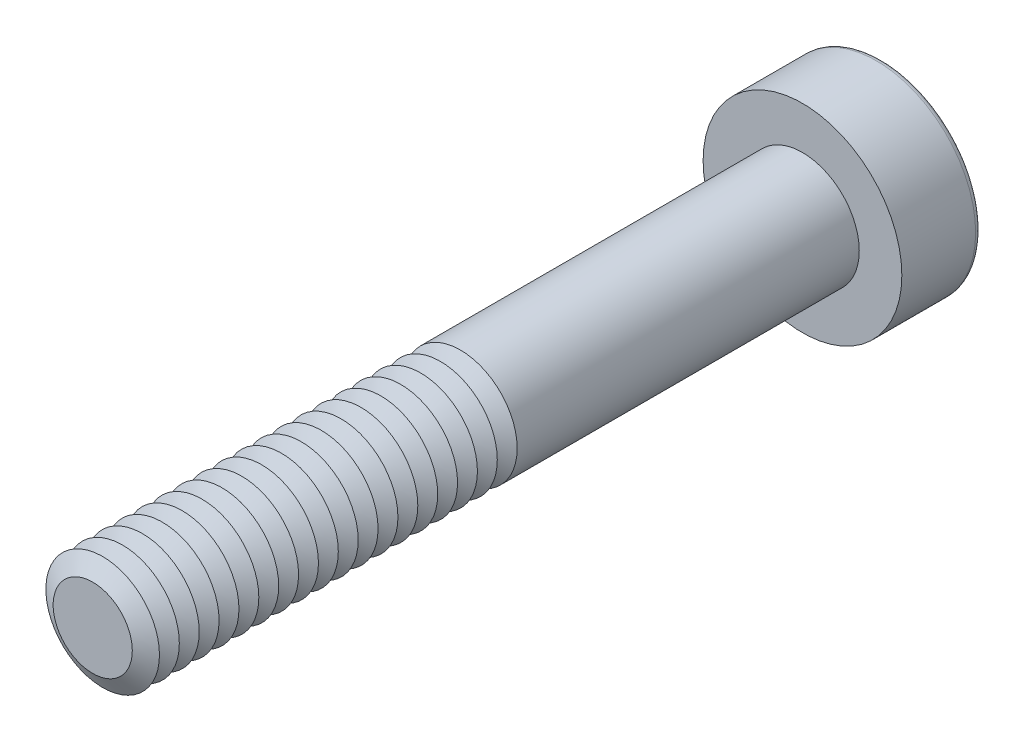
ISO-10303-21;
HEADER;
FILE_DESCRIPTION(('STEP AP214'),'2;1');
FILE_NAME('part.step','',(''),(''),'','','');
FILE_SCHEMA(('AUTOMOTIVE_DESIGN { 1 0 10303 214 1 1 1 1 }'));
ENDSEC;
DATA;
#1=APPLICATION_CONTEXT('core data for automotive mechanical design processes');
#2=APPLICATION_PROTOCOL_DEFINITION('international standard','automotive_design',2000,#1);
#3=PRODUCT_CONTEXT('',#1,'mechanical');
#4=PRODUCT('Part','Part','',(#3));
#5=PRODUCT_RELATED_PRODUCT_CATEGORY('part','',(#4));
#6=PRODUCT_DEFINITION_FORMATION('','',#4);
#7=PRODUCT_DEFINITION_CONTEXT('part definition',#1,'design');
#8=PRODUCT_DEFINITION('design','',#6,#7);
#9=PRODUCT_DEFINITION_SHAPE('','',#8);
#10=(LENGTH_UNIT() NAMED_UNIT(*) SI_UNIT(.MILLI.,.METRE.));
#11=(NAMED_UNIT(*) PLANE_ANGLE_UNIT() SI_UNIT($,.RADIAN.));
#12=(NAMED_UNIT(*) SI_UNIT($,.STERADIAN.) SOLID_ANGLE_UNIT());
#13=UNCERTAINTY_MEASURE_WITH_UNIT(LENGTH_MEASURE(1.E-05),#10,'distance_accuracy_value','');
#14=(GEOMETRIC_REPRESENTATION_CONTEXT(3) GLOBAL_UNCERTAINTY_ASSIGNED_CONTEXT((#13)) GLOBAL_UNIT_ASSIGNED_CONTEXT((#10,
#11,#12)) REPRESENTATION_CONTEXT('',''));
#15=CARTESIAN_POINT('',(0.,0.,0.));
#16=DIRECTION('',(0.,0.,1.));
#17=DIRECTION('',(1.,0.,0.));
#18=AXIS2_PLACEMENT_3D('',#15,#16,#17);
#19=CARTESIAN_POINT('',(0.,0.,22.55));
#20=DIRECTION('',(0.,0.,1.));
#21=DIRECTION('',(1.,0.,0.));
#22=AXIS2_PLACEMENT_3D('',#19,#20,#21);
#23=CONICAL_SURFACE('',#22,2.,1.0471975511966);
#24=CARTESIAN_POINT('',(0.,0.,22.2));
#25=DIRECTION('',(0.,0.,1.));
#26=DIRECTION('',(1.,0.,0.));
#27=AXIS2_PLACEMENT_3D('',#24,#25,#26);
#28=CIRCLE('',#27,1.39378221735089);
#29=CARTESIAN_POINT('',(1.39378221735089,0.,22.2));
#30=VERTEX_POINT('',#29);
#31=EDGE_CURVE('E312',#30,#30,#28,.T.);
#32=ORIENTED_EDGE('',*,*,#31,.T.);
#33=EDGE_LOOP('',(#32));
#34=FACE_BOUND('',#33,.T.);
#35=CARTESIAN_POINT('',(0.,0.,22.55));
#36=DIRECTION('',(0.,0.,1.));
#37=DIRECTION('',(1.,0.,0.));
#38=AXIS2_PLACEMENT_3D('',#35,#36,#37);
#39=CIRCLE('',#38,2.);
#40=CARTESIAN_POINT('',(2.,0.,22.55));
#41=VERTEX_POINT('',#40);
#42=EDGE_CURVE('E315',#41,#41,#39,.T.);
#43=ORIENTED_EDGE('',*,*,#42,.F.);
#44=EDGE_LOOP('',(#43));
#45=FACE_BOUND('',#44,.T.);
#46=ADVANCED_FACE('F39',(#34,#45),#23,.T.);
#47=CARTESIAN_POINT('',(0.,0.,22.2));
#48=DIRECTION('',(0.,0.,-1.));
#49=DIRECTION('',(-1.,0.,0.));
#50=AXIS2_PLACEMENT_3D('',#47,#48,#49);
#51=CONICAL_SURFACE('',#50,1.39378221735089,1.0471975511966);
#52=CARTESIAN_POINT('',(0.,0.,21.85));
#53=DIRECTION('',(0.,0.,1.));
#54=DIRECTION('',(1.,0.,0.));
#55=AXIS2_PLACEMENT_3D('',#52,#53,#54);
#56=CIRCLE('',#55,2.);
#57=CARTESIAN_POINT('',(2.,0.,21.85));
#58=VERTEX_POINT('',#57);
#59=EDGE_CURVE('E323',#58,#58,#56,.T.);
#60=ORIENTED_EDGE('',*,*,#59,.T.);
#61=EDGE_LOOP('',(#60));
#62=FACE_BOUND('',#61,.T.);
#63=ORIENTED_EDGE('',*,*,#31,.F.);
#64=EDGE_LOOP('',(#63));
#65=FACE_BOUND('',#64,.T.);
#66=ADVANCED_FACE('F244',(#62,#65),#51,.T.);
#67=CARTESIAN_POINT('',(0.,0.,25.));
#68=DIRECTION('',(0.,0.,1.));
#69=DIRECTION('',(1.,0.,0.));
#70=AXIS2_PLACEMENT_3D('',#67,#68,#69);
#71=PLANE('',#70);
#72=CARTESIAN_POINT('',(0.,0.,25.));
#73=DIRECTION('',(0.,0.,1.));
#74=DIRECTION('',(1.,0.,0.));
#75=AXIS2_PLACEMENT_3D('',#72,#73,#74);
#76=CIRCLE('',#75,1.39378221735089);
#77=CARTESIAN_POINT('',(1.39378221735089,0.,25.));
#78=VERTEX_POINT('',#77);
#79=EDGE_CURVE('E174',#78,#78,#76,.T.);
#80=ORIENTED_EDGE('',*,*,#79,.T.);
#81=EDGE_LOOP('',(#80));
#82=FACE_BOUND('',#81,.T.);
#83=ADVANCED_FACE('F250',(#82),#71,.T.);
#84=CARTESIAN_POINT('',(0.,0.,25.));
#85=DIRECTION('',(0.,0.,-1.));
#86=DIRECTION('',(-1.,0.,0.));
#87=AXIS2_PLACEMENT_3D('',#84,#85,#86);
#88=CONICAL_SURFACE('',#87,1.39378221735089,1.0471975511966);
#89=CARTESIAN_POINT('',(0.,0.,24.65));
#90=DIRECTION('',(0.,0.,1.));
#91=DIRECTION('',(1.,0.,0.));
#92=AXIS2_PLACEMENT_3D('',#89,#90,#91);
#93=CIRCLE('',#92,2.);
#94=CARTESIAN_POINT('',(2.,0.,24.65));
#95=VERTEX_POINT('',#94);
#96=EDGE_CURVE('E290',#95,#95,#93,.T.);
#97=ORIENTED_EDGE('',*,*,#96,.T.);
#98=EDGE_LOOP('',(#97));
#99=FACE_BOUND('',#98,.T.);
#100=ORIENTED_EDGE('',*,*,#79,.F.);
#101=EDGE_LOOP('',(#100));
#102=FACE_BOUND('',#101,.T.);
#103=ADVANCED_FACE('F199',(#99,#102),#88,.T.);
#104=CARTESIAN_POINT('',(0.,0.,24.65));
#105=DIRECTION('',(0.,0.,1.));
#106=DIRECTION('',(1.,0.,0.));
#107=AXIS2_PLACEMENT_3D('',#104,#105,#106);
#108=CONICAL_SURFACE('',#107,2.,1.0471975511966);
#109=CARTESIAN_POINT('',(0.,0.,24.3));
#110=DIRECTION('',(0.,0.,1.));
#111=DIRECTION('',(1.,0.,0.));
#112=AXIS2_PLACEMENT_3D('',#109,#110,#111);
#113=CIRCLE('',#112,1.39378221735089);
#114=CARTESIAN_POINT('',(1.39378221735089,0.,24.3));
#115=VERTEX_POINT('',#114);
#116=EDGE_CURVE('E287',#115,#115,#113,.T.);
#117=ORIENTED_EDGE('',*,*,#116,.T.);
#118=EDGE_LOOP('',(#117));
#119=FACE_BOUND('',#118,.T.);
#120=ORIENTED_EDGE('',*,*,#96,.F.);
#121=EDGE_LOOP('',(#120));
#122=FACE_BOUND('',#121,.T.);
#123=ADVANCED_FACE('F276',(#119,#122),#108,.T.);
#124=CARTESIAN_POINT('',(0.,0.,24.3));
#125=DIRECTION('',(0.,0.,-1.));
#126=DIRECTION('',(-1.,0.,0.));
#127=AXIS2_PLACEMENT_3D('',#124,#125,#126);
#128=CONICAL_SURFACE('',#127,1.39378221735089,1.0471975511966);
#129=CARTESIAN_POINT('',(0.,0.,23.95));
#130=DIRECTION('',(0.,0.,1.));
#131=DIRECTION('',(1.,0.,0.));
#132=AXIS2_PLACEMENT_3D('',#129,#130,#131);
#133=CIRCLE('',#132,2.);
#134=CARTESIAN_POINT('',(2.,0.,23.95));
#135=VERTEX_POINT('',#134);
#136=EDGE_CURVE('E299',#135,#135,#133,.T.);
#137=ORIENTED_EDGE('',*,*,#136,.T.);
#138=EDGE_LOOP('',(#137));
#139=FACE_BOUND('',#138,.T.);
#140=ORIENTED_EDGE('',*,*,#116,.F.);
#141=EDGE_LOOP('',(#140));
#142=FACE_BOUND('',#141,.T.);
#143=ADVANCED_FACE('F273',(#139,#142),#128,.T.);
#144=CARTESIAN_POINT('',(0.,0.,23.95));
#145=DIRECTION('',(0.,0.,1.));
#146=DIRECTION('',(1.,0.,0.));
#147=AXIS2_PLACEMENT_3D('',#144,#145,#146);
#148=CONICAL_SURFACE('',#147,2.,1.0471975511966);
#149=CARTESIAN_POINT('',(0.,0.,23.6));
#150=DIRECTION('',(0.,0.,1.));
#151=DIRECTION('',(1.,0.,0.));
#152=AXIS2_PLACEMENT_3D('',#149,#150,#151);
#153=CIRCLE('',#152,1.39378221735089);
#154=CARTESIAN_POINT('',(1.39378221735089,0.,23.6));
#155=VERTEX_POINT('',#154);
#156=EDGE_CURVE('E292',#155,#155,#153,.T.);
#157=ORIENTED_EDGE('',*,*,#156,.T.);
#158=EDGE_LOOP('',(#157));
#159=FACE_BOUND('',#158,.T.);
#160=ORIENTED_EDGE('',*,*,#136,.F.);
#161=EDGE_LOOP('',(#160));
#162=FACE_BOUND('',#161,.T.);
#163=ADVANCED_FACE('F269',(#159,#162),#148,.T.);
#164=CARTESIAN_POINT('',(0.,0.,23.6));
#165=DIRECTION('',(0.,0.,-1.));
#166=DIRECTION('',(-1.,0.,0.));
#167=AXIS2_PLACEMENT_3D('',#164,#165,#166);
#168=CONICAL_SURFACE('',#167,1.39378221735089,1.0471975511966);
#169=CARTESIAN_POINT('',(0.,0.,23.25));
#170=DIRECTION('',(0.,0.,1.));
#171=DIRECTION('',(1.,0.,0.));
#172=AXIS2_PLACEMENT_3D('',#169,#170,#171);
#173=CIRCLE('',#172,2.);
#174=CARTESIAN_POINT('',(2.,0.,23.25));
#175=VERTEX_POINT('',#174);
#176=EDGE_CURVE('E309',#175,#175,#173,.T.);
#177=ORIENTED_EDGE('',*,*,#176,.T.);
#178=EDGE_LOOP('',(#177));
#179=FACE_BOUND('',#178,.T.);
#180=ORIENTED_EDGE('',*,*,#156,.F.);
#181=EDGE_LOOP('',(#180));
#182=FACE_BOUND('',#181,.T.);
#183=ADVANCED_FACE('F265',(#179,#182),#168,.T.);
#184=CARTESIAN_POINT('',(0.,0.,23.25));
#185=DIRECTION('',(0.,0.,1.));
#186=DIRECTION('',(1.,0.,0.));
#187=AXIS2_PLACEMENT_3D('',#184,#185,#186);
#188=CONICAL_SURFACE('',#187,2.,1.0471975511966);
#189=CARTESIAN_POINT('',(0.,0.,22.9));
#190=DIRECTION('',(0.,0.,1.));
#191=DIRECTION('',(1.,0.,0.));
#192=AXIS2_PLACEMENT_3D('',#189,#190,#191);
#193=CIRCLE('',#192,1.39378221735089);
#194=CARTESIAN_POINT('',(1.39378221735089,0.,22.9));
#195=VERTEX_POINT('',#194);
#196=EDGE_CURVE('E305',#195,#195,#193,.T.);
#197=ORIENTED_EDGE('',*,*,#196,.T.);
#198=EDGE_LOOP('',(#197));
#199=FACE_BOUND('',#198,.T.);
#200=ORIENTED_EDGE('',*,*,#176,.F.);
#201=EDGE_LOOP('',(#200));
#202=FACE_BOUND('',#201,.T.);
#203=ADVANCED_FACE('F261',(#199,#202),#188,.T.);
#204=CARTESIAN_POINT('',(0.,0.,22.9));
#205=DIRECTION('',(0.,0.,-1.));
#206=DIRECTION('',(-1.,0.,0.));
#207=AXIS2_PLACEMENT_3D('',#204,#205,#206);
#208=CONICAL_SURFACE('',#207,1.39378221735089,1.0471975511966);
#209=ORIENTED_EDGE('',*,*,#42,.T.);
#210=EDGE_LOOP('',(#209));
#211=FACE_BOUND('',#210,.T.);
#212=ORIENTED_EDGE('',*,*,#196,.F.);
#213=EDGE_LOOP('',(#212));
#214=FACE_BOUND('',#213,.T.);
#215=ADVANCED_FACE('F257',(#211,#214),#208,.T.);
#216=CARTESIAN_POINT('',(0.,0.,21.85));
#217=DIRECTION('',(0.,0.,1.));
#218=DIRECTION('',(1.,0.,0.));
#219=AXIS2_PLACEMENT_3D('',#216,#217,#218);
#220=CONICAL_SURFACE('',#219,2.,1.0471975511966);
#221=CARTESIAN_POINT('',(0.,0.,21.5));
#222=DIRECTION('',(0.,0.,1.));
#223=DIRECTION('',(1.,0.,0.));
#224=AXIS2_PLACEMENT_3D('',#221,#222,#223);
#225=CIRCLE('',#224,1.39378221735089);
#226=CARTESIAN_POINT('',(1.39378221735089,0.,21.5));
#227=VERTEX_POINT('',#226);
#228=EDGE_CURVE('E319',#227,#227,#225,.T.);
#229=ORIENTED_EDGE('',*,*,#228,.T.);
#230=EDGE_LOOP('',(#229));
#231=FACE_BOUND('',#230,.T.);
#232=ORIENTED_EDGE('',*,*,#59,.F.);
#233=EDGE_LOOP('',(#232));
#234=FACE_BOUND('',#233,.T.);
#235=ADVANCED_FACE('F260',(#231,#234),#220,.T.);
#236=CARTESIAN_POINT('',(0.,0.,21.5));
#237=DIRECTION('',(0.,0.,-1.));
#238=DIRECTION('',(-1.,0.,0.));
#239=AXIS2_PLACEMENT_3D('',#236,#237,#238);
#240=CONICAL_SURFACE('',#239,1.39378221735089,1.0471975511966);
#241=CARTESIAN_POINT('',(0.,0.,21.15));
#242=DIRECTION('',(0.,0.,1.));
#243=DIRECTION('',(1.,0.,0.));
#244=AXIS2_PLACEMENT_3D('',#241,#242,#243);
#245=CIRCLE('',#244,2.);
#246=CARTESIAN_POINT('',(2.,0.,21.15));
#247=VERTEX_POINT('',#246);
#248=EDGE_CURVE('E330',#247,#247,#245,.T.);
#249=ORIENTED_EDGE('',*,*,#248,.T.);
#250=EDGE_LOOP('',(#249));
#251=FACE_BOUND('',#250,.T.);
#252=ORIENTED_EDGE('',*,*,#228,.F.);
#253=EDGE_LOOP('',(#252));
#254=FACE_BOUND('',#253,.T.);
#255=ADVANCED_FACE('F543',(#251,#254),#240,.T.);
#256=CARTESIAN_POINT('',(0.,0.,21.15));
#257=DIRECTION('',(0.,0.,1.));
#258=DIRECTION('',(1.,0.,0.));
#259=AXIS2_PLACEMENT_3D('',#256,#257,#258);
#260=CONICAL_SURFACE('',#259,2.,1.0471975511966);
#261=CARTESIAN_POINT('',(0.,0.,20.8));
#262=DIRECTION('',(0.,0.,1.));
#263=DIRECTION('',(1.,0.,0.));
#264=AXIS2_PLACEMENT_3D('',#261,#262,#263);
#265=CIRCLE('',#264,1.39378221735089);
#266=CARTESIAN_POINT('',(1.39378221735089,0.,20.8));
#267=VERTEX_POINT('',#266);
#268=EDGE_CURVE('E326',#267,#267,#265,.T.);
#269=ORIENTED_EDGE('',*,*,#268,.T.);
#270=EDGE_LOOP('',(#269));
#271=FACE_BOUND('',#270,.T.);
#272=ORIENTED_EDGE('',*,*,#248,.F.);
#273=EDGE_LOOP('',(#272));
#274=FACE_BOUND('',#273,.T.);
#275=ADVANCED_FACE('F539',(#271,#274),#260,.T.);
#276=CARTESIAN_POINT('',(0.,0.,20.8));
#277=DIRECTION('',(0.,0.,-1.));
#278=DIRECTION('',(-1.,0.,0.));
#279=AXIS2_PLACEMENT_3D('',#276,#277,#278);
#280=CONICAL_SURFACE('',#279,1.39378221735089,1.0471975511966);
#281=CARTESIAN_POINT('',(0.,0.,20.45));
#282=DIRECTION('',(0.,0.,1.));
#283=DIRECTION('',(1.,0.,0.));
#284=AXIS2_PLACEMENT_3D('',#281,#282,#283);
#285=CIRCLE('',#284,2.);
#286=CARTESIAN_POINT('',(2.,0.,20.45));
#287=VERTEX_POINT('',#286);
#288=EDGE_CURVE('E338',#287,#287,#285,.T.);
#289=ORIENTED_EDGE('',*,*,#288,.T.);
#290=EDGE_LOOP('',(#289));
#291=FACE_BOUND('',#290,.T.);
#292=ORIENTED_EDGE('',*,*,#268,.F.);
#293=EDGE_LOOP('',(#292));
#294=FACE_BOUND('',#293,.T.);
#295=ADVANCED_FACE('F535',(#291,#294),#280,.T.);
#296=CARTESIAN_POINT('',(0.,0.,20.45));
#297=DIRECTION('',(0.,0.,1.));
#298=DIRECTION('',(1.,0.,0.));
#299=AXIS2_PLACEMENT_3D('',#296,#297,#298);
#300=CONICAL_SURFACE('',#299,2.,1.0471975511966);
#301=CARTESIAN_POINT('',(0.,0.,20.1));
#302=DIRECTION('',(0.,0.,1.));
#303=DIRECTION('',(1.,0.,0.));
#304=AXIS2_PLACEMENT_3D('',#301,#302,#303);
#305=CIRCLE('',#304,1.39378221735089);
#306=CARTESIAN_POINT('',(1.39378221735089,0.,20.1));
#307=VERTEX_POINT('',#306);
#308=EDGE_CURVE('E334',#307,#307,#305,.T.);
#309=ORIENTED_EDGE('',*,*,#308,.T.);
#310=EDGE_LOOP('',(#309));
#311=FACE_BOUND('',#310,.T.);
#312=ORIENTED_EDGE('',*,*,#288,.F.);
#313=EDGE_LOOP('',(#312));
#314=FACE_BOUND('',#313,.T.);
#315=ADVANCED_FACE('F531',(#311,#314),#300,.T.);
#316=CARTESIAN_POINT('',(0.,0.,20.1));
#317=DIRECTION('',(0.,0.,-1.));
#318=DIRECTION('',(-1.,0.,0.));
#319=AXIS2_PLACEMENT_3D('',#316,#317,#318);
#320=CONICAL_SURFACE('',#319,1.39378221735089,1.0471975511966);
#321=CARTESIAN_POINT('',(0.,0.,19.75));
#322=DIRECTION('',(0.,0.,1.));
#323=DIRECTION('',(1.,0.,0.));
#324=AXIS2_PLACEMENT_3D('',#321,#322,#323);
#325=CIRCLE('',#324,2.);
#326=CARTESIAN_POINT('',(2.,0.,19.75));
#327=VERTEX_POINT('',#326);
#328=EDGE_CURVE('E346',#327,#327,#325,.T.);
#329=ORIENTED_EDGE('',*,*,#328,.T.);
#330=EDGE_LOOP('',(#329));
#331=FACE_BOUND('',#330,.T.);
#332=ORIENTED_EDGE('',*,*,#308,.F.);
#333=EDGE_LOOP('',(#332));
#334=FACE_BOUND('',#333,.T.);
#335=ADVANCED_FACE('F527',(#331,#334),#320,.T.);
#336=CARTESIAN_POINT('',(0.,0.,19.75));
#337=DIRECTION('',(0.,0.,1.));
#338=DIRECTION('',(1.,0.,0.));
#339=AXIS2_PLACEMENT_3D('',#336,#337,#338);
#340=CONICAL_SURFACE('',#339,2.,1.0471975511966);
#341=CARTESIAN_POINT('',(0.,0.,19.4));
#342=DIRECTION('',(0.,0.,1.));
#343=DIRECTION('',(1.,0.,0.));
#344=AXIS2_PLACEMENT_3D('',#341,#342,#343);
#345=CIRCLE('',#344,1.39378221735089);
#346=CARTESIAN_POINT('',(1.39378221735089,0.,19.4));
#347=VERTEX_POINT('',#346);
#348=EDGE_CURVE('E342',#347,#347,#345,.T.);
#349=ORIENTED_EDGE('',*,*,#348,.T.);
#350=EDGE_LOOP('',(#349));
#351=FACE_BOUND('',#350,.T.);
#352=ORIENTED_EDGE('',*,*,#328,.F.);
#353=EDGE_LOOP('',(#352));
#354=FACE_BOUND('',#353,.T.);
#355=ADVANCED_FACE('F523',(#351,#354),#340,.T.);
#356=CARTESIAN_POINT('',(0.,0.,19.4));
#357=DIRECTION('',(0.,0.,-1.));
#358=DIRECTION('',(-1.,0.,0.));
#359=AXIS2_PLACEMENT_3D('',#356,#357,#358);
#360=CONICAL_SURFACE('',#359,1.39378221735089,1.0471975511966);
#361=CARTESIAN_POINT('',(0.,0.,19.05));
#362=DIRECTION('',(0.,0.,1.));
#363=DIRECTION('',(1.,0.,0.));
#364=AXIS2_PLACEMENT_3D('',#361,#362,#363);
#365=CIRCLE('',#364,2.);
#366=CARTESIAN_POINT('',(2.,0.,19.05));
#367=VERTEX_POINT('',#366);
#368=EDGE_CURVE('E354',#367,#367,#365,.T.);
#369=ORIENTED_EDGE('',*,*,#368,.T.);
#370=EDGE_LOOP('',(#369));
#371=FACE_BOUND('',#370,.T.);
#372=ORIENTED_EDGE('',*,*,#348,.F.);
#373=EDGE_LOOP('',(#372));
#374=FACE_BOUND('',#373,.T.);
#375=ADVANCED_FACE('F519',(#371,#374),#360,.T.);
#376=CARTESIAN_POINT('',(0.,0.,19.05));
#377=DIRECTION('',(0.,0.,1.));
#378=DIRECTION('',(1.,0.,0.));
#379=AXIS2_PLACEMENT_3D('',#376,#377,#378);
#380=CONICAL_SURFACE('',#379,2.,1.0471975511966);
#381=CARTESIAN_POINT('',(0.,0.,18.7));
#382=DIRECTION('',(0.,0.,1.));
#383=DIRECTION('',(1.,0.,0.));
#384=AXIS2_PLACEMENT_3D('',#381,#382,#383);
#385=CIRCLE('',#384,1.39378221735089);
#386=CARTESIAN_POINT('',(1.39378221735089,0.,18.7));
#387=VERTEX_POINT('',#386);
#388=EDGE_CURVE('E350',#387,#387,#385,.T.);
#389=ORIENTED_EDGE('',*,*,#388,.T.);
#390=EDGE_LOOP('',(#389));
#391=FACE_BOUND('',#390,.T.);
#392=ORIENTED_EDGE('',*,*,#368,.F.);
#393=EDGE_LOOP('',(#392));
#394=FACE_BOUND('',#393,.T.);
#395=ADVANCED_FACE('F515',(#391,#394),#380,.T.);
#396=CARTESIAN_POINT('',(0.,0.,18.7));
#397=DIRECTION('',(0.,0.,-1.));
#398=DIRECTION('',(-1.,0.,0.));
#399=AXIS2_PLACEMENT_3D('',#396,#397,#398);
#400=CONICAL_SURFACE('',#399,1.39378221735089,1.0471975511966);
#401=CARTESIAN_POINT('',(0.,0.,18.35));
#402=DIRECTION('',(0.,0.,1.));
#403=DIRECTION('',(1.,0.,0.));
#404=AXIS2_PLACEMENT_3D('',#401,#402,#403);
#405=CIRCLE('',#404,2.);
#406=CARTESIAN_POINT('',(2.,0.,18.35));
#407=VERTEX_POINT('',#406);
#408=EDGE_CURVE('E362',#407,#407,#405,.T.);
#409=ORIENTED_EDGE('',*,*,#408,.T.);
#410=EDGE_LOOP('',(#409));
#411=FACE_BOUND('',#410,.T.);
#412=ORIENTED_EDGE('',*,*,#388,.F.);
#413=EDGE_LOOP('',(#412));
#414=FACE_BOUND('',#413,.T.);
#415=ADVANCED_FACE('F511',(#411,#414),#400,.T.);
#416=CARTESIAN_POINT('',(0.,0.,18.35));
#417=DIRECTION('',(0.,0.,1.));
#418=DIRECTION('',(1.,0.,0.));
#419=AXIS2_PLACEMENT_3D('',#416,#417,#418);
#420=CONICAL_SURFACE('',#419,2.,1.0471975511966);
#421=CARTESIAN_POINT('',(0.,0.,18.));
#422=DIRECTION('',(0.,0.,1.));
#423=DIRECTION('',(1.,0.,0.));
#424=AXIS2_PLACEMENT_3D('',#421,#422,#423);
#425=CIRCLE('',#424,1.39378221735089);
#426=CARTESIAN_POINT('',(1.39378221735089,0.,18.));
#427=VERTEX_POINT('',#426);
#428=EDGE_CURVE('E358',#427,#427,#425,.T.);
#429=ORIENTED_EDGE('',*,*,#428,.T.);
#430=EDGE_LOOP('',(#429));
#431=FACE_BOUND('',#430,.T.);
#432=ORIENTED_EDGE('',*,*,#408,.F.);
#433=EDGE_LOOP('',(#432));
#434=FACE_BOUND('',#433,.T.);
#435=ADVANCED_FACE('F507',(#431,#434),#420,.T.);
#436=CARTESIAN_POINT('',(0.,0.,18.));
#437=DIRECTION('',(0.,0.,-1.));
#438=DIRECTION('',(-1.,0.,0.));
#439=AXIS2_PLACEMENT_3D('',#436,#437,#438);
#440=CONICAL_SURFACE('',#439,1.39378221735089,1.0471975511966);
#441=CARTESIAN_POINT('',(0.,0.,17.65));
#442=DIRECTION('',(0.,0.,1.));
#443=DIRECTION('',(1.,0.,0.));
#444=AXIS2_PLACEMENT_3D('',#441,#442,#443);
#445=CIRCLE('',#444,2.);
#446=CARTESIAN_POINT('',(2.,0.,17.65));
#447=VERTEX_POINT('',#446);
#448=EDGE_CURVE('E370',#447,#447,#445,.T.);
#449=ORIENTED_EDGE('',*,*,#448,.T.);
#450=EDGE_LOOP('',(#449));
#451=FACE_BOUND('',#450,.T.);
#452=ORIENTED_EDGE('',*,*,#428,.F.);
#453=EDGE_LOOP('',(#452));
#454=FACE_BOUND('',#453,.T.);
#455=ADVANCED_FACE('F503',(#451,#454),#440,.T.);
#456=CARTESIAN_POINT('',(0.,0.,17.65));
#457=DIRECTION('',(0.,0.,1.));
#458=DIRECTION('',(1.,0.,0.));
#459=AXIS2_PLACEMENT_3D('',#456,#457,#458);
#460=CONICAL_SURFACE('',#459,2.,1.0471975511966);
#461=CARTESIAN_POINT('',(0.,0.,17.3));
#462=DIRECTION('',(0.,0.,1.));
#463=DIRECTION('',(1.,0.,0.));
#464=AXIS2_PLACEMENT_3D('',#461,#462,#463);
#465=CIRCLE('',#464,1.39378221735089);
#466=CARTESIAN_POINT('',(1.39378221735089,0.,17.3));
#467=VERTEX_POINT('',#466);
#468=EDGE_CURVE('E366',#467,#467,#465,.T.);
#469=ORIENTED_EDGE('',*,*,#468,.T.);
#470=EDGE_LOOP('',(#469));
#471=FACE_BOUND('',#470,.T.);
#472=ORIENTED_EDGE('',*,*,#448,.F.);
#473=EDGE_LOOP('',(#472));
#474=FACE_BOUND('',#473,.T.);
#475=ADVANCED_FACE('F499',(#471,#474),#460,.T.);
#476=CARTESIAN_POINT('',(0.,0.,17.3));
#477=DIRECTION('',(0.,0.,-1.));
#478=DIRECTION('',(-1.,0.,0.));
#479=AXIS2_PLACEMENT_3D('',#476,#477,#478);
#480=CONICAL_SURFACE('',#479,1.39378221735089,1.0471975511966);
#481=CARTESIAN_POINT('',(0.,0.,16.95));
#482=DIRECTION('',(0.,0.,1.));
#483=DIRECTION('',(1.,0.,0.));
#484=AXIS2_PLACEMENT_3D('',#481,#482,#483);
#485=CIRCLE('',#484,2.);
#486=CARTESIAN_POINT('',(2.,0.,16.95));
#487=VERTEX_POINT('',#486);
#488=EDGE_CURVE('E378',#487,#487,#485,.T.);
#489=ORIENTED_EDGE('',*,*,#488,.T.);
#490=EDGE_LOOP('',(#489));
#491=FACE_BOUND('',#490,.T.);
#492=ORIENTED_EDGE('',*,*,#468,.F.);
#493=EDGE_LOOP('',(#492));
#494=FACE_BOUND('',#493,.T.);
#495=ADVANCED_FACE('F495',(#491,#494),#480,.T.);
#496=CARTESIAN_POINT('',(0.,0.,16.95));
#497=DIRECTION('',(0.,0.,1.));
#498=DIRECTION('',(1.,0.,0.));
#499=AXIS2_PLACEMENT_3D('',#496,#497,#498);
#500=CONICAL_SURFACE('',#499,2.,1.0471975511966);
#501=CARTESIAN_POINT('',(0.,0.,16.6));
#502=DIRECTION('',(0.,0.,1.));
#503=DIRECTION('',(1.,0.,0.));
#504=AXIS2_PLACEMENT_3D('',#501,#502,#503);
#505=CIRCLE('',#504,1.39378221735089);
#506=CARTESIAN_POINT('',(1.39378221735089,0.,16.6));
#507=VERTEX_POINT('',#506);
#508=EDGE_CURVE('E374',#507,#507,#505,.T.);
#509=ORIENTED_EDGE('',*,*,#508,.T.);
#510=EDGE_LOOP('',(#509));
#511=FACE_BOUND('',#510,.T.);
#512=ORIENTED_EDGE('',*,*,#488,.F.);
#513=EDGE_LOOP('',(#512));
#514=FACE_BOUND('',#513,.T.);
#515=ADVANCED_FACE('F491',(#511,#514),#500,.T.);
#516=CARTESIAN_POINT('',(0.,0.,16.6));
#517=DIRECTION('',(0.,0.,-1.));
#518=DIRECTION('',(-1.,0.,0.));
#519=AXIS2_PLACEMENT_3D('',#516,#517,#518);
#520=CONICAL_SURFACE('',#519,1.39378221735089,1.0471975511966);
#521=CARTESIAN_POINT('',(0.,0.,16.25));
#522=DIRECTION('',(0.,0.,1.));
#523=DIRECTION('',(1.,0.,0.));
#524=AXIS2_PLACEMENT_3D('',#521,#522,#523);
#525=CIRCLE('',#524,2.);
#526=CARTESIAN_POINT('',(2.,0.,16.25));
#527=VERTEX_POINT('',#526);
#528=EDGE_CURVE('E386',#527,#527,#525,.T.);
#529=ORIENTED_EDGE('',*,*,#528,.T.);
#530=EDGE_LOOP('',(#529));
#531=FACE_BOUND('',#530,.T.);
#532=ORIENTED_EDGE('',*,*,#508,.F.);
#533=EDGE_LOOP('',(#532));
#534=FACE_BOUND('',#533,.T.);
#535=ADVANCED_FACE('F487',(#531,#534),#520,.T.);
#536=CARTESIAN_POINT('',(0.,0.,16.25));
#537=DIRECTION('',(0.,0.,1.));
#538=DIRECTION('',(1.,0.,0.));
#539=AXIS2_PLACEMENT_3D('',#536,#537,#538);
#540=CONICAL_SURFACE('',#539,2.,1.0471975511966);
#541=CARTESIAN_POINT('',(0.,0.,15.9));
#542=DIRECTION('',(0.,0.,1.));
#543=DIRECTION('',(1.,0.,0.));
#544=AXIS2_PLACEMENT_3D('',#541,#542,#543);
#545=CIRCLE('',#544,1.39378221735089);
#546=CARTESIAN_POINT('',(1.39378221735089,0.,15.9));
#547=VERTEX_POINT('',#546);
#548=EDGE_CURVE('E382',#547,#547,#545,.T.);
#549=ORIENTED_EDGE('',*,*,#548,.T.);
#550=EDGE_LOOP('',(#549));
#551=FACE_BOUND('',#550,.T.);
#552=ORIENTED_EDGE('',*,*,#528,.F.);
#553=EDGE_LOOP('',(#552));
#554=FACE_BOUND('',#553,.T.);
#555=ADVANCED_FACE('F483',(#551,#554),#540,.T.);
#556=CARTESIAN_POINT('',(0.,0.,15.9));
#557=DIRECTION('',(0.,0.,-1.));
#558=DIRECTION('',(-1.,0.,0.));
#559=AXIS2_PLACEMENT_3D('',#556,#557,#558);
#560=CONICAL_SURFACE('',#559,1.39378221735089,1.0471975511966);
#561=CARTESIAN_POINT('',(0.,0.,15.55));
#562=DIRECTION('',(0.,0.,1.));
#563=DIRECTION('',(1.,0.,0.));
#564=AXIS2_PLACEMENT_3D('',#561,#562,#563);
#565=CIRCLE('',#564,2.);
#566=CARTESIAN_POINT('',(2.,0.,15.55));
#567=VERTEX_POINT('',#566);
#568=EDGE_CURVE('E394',#567,#567,#565,.T.);
#569=ORIENTED_EDGE('',*,*,#568,.T.);
#570=EDGE_LOOP('',(#569));
#571=FACE_BOUND('',#570,.T.);
#572=ORIENTED_EDGE('',*,*,#548,.F.);
#573=EDGE_LOOP('',(#572));
#574=FACE_BOUND('',#573,.T.);
#575=ADVANCED_FACE('F479',(#571,#574),#560,.T.);
#576=CARTESIAN_POINT('',(0.,0.,15.55));
#577=DIRECTION('',(0.,0.,1.));
#578=DIRECTION('',(1.,0.,0.));
#579=AXIS2_PLACEMENT_3D('',#576,#577,#578);
#580=CONICAL_SURFACE('',#579,2.,1.0471975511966);
#581=CARTESIAN_POINT('',(0.,0.,15.2));
#582=DIRECTION('',(0.,0.,1.));
#583=DIRECTION('',(1.,0.,0.));
#584=AXIS2_PLACEMENT_3D('',#581,#582,#583);
#585=CIRCLE('',#584,1.39378221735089);
#586=CARTESIAN_POINT('',(1.39378221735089,0.,15.2));
#587=VERTEX_POINT('',#586);
#588=EDGE_CURVE('E390',#587,#587,#585,.T.);
#589=ORIENTED_EDGE('',*,*,#588,.T.);
#590=EDGE_LOOP('',(#589));
#591=FACE_BOUND('',#590,.T.);
#592=ORIENTED_EDGE('',*,*,#568,.F.);
#593=EDGE_LOOP('',(#592));
#594=FACE_BOUND('',#593,.T.);
#595=ADVANCED_FACE('F475',(#591,#594),#580,.T.);
#596=CARTESIAN_POINT('',(0.,0.,15.2));
#597=DIRECTION('',(0.,0.,-1.));
#598=DIRECTION('',(-1.,0.,0.));
#599=AXIS2_PLACEMENT_3D('',#596,#597,#598);
#600=CONICAL_SURFACE('',#599,1.39378221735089,1.0471975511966);
#601=CARTESIAN_POINT('',(0.,0.,14.85));
#602=DIRECTION('',(0.,0.,1.));
#603=DIRECTION('',(1.,0.,0.));
#604=AXIS2_PLACEMENT_3D('',#601,#602,#603);
#605=CIRCLE('',#604,2.);
#606=CARTESIAN_POINT('',(2.,0.,14.85));
#607=VERTEX_POINT('',#606);
#608=EDGE_CURVE('E402',#607,#607,#605,.T.);
#609=ORIENTED_EDGE('',*,*,#608,.T.);
#610=EDGE_LOOP('',(#609));
#611=FACE_BOUND('',#610,.T.);
#612=ORIENTED_EDGE('',*,*,#588,.F.);
#613=EDGE_LOOP('',(#612));
#614=FACE_BOUND('',#613,.T.);
#615=ADVANCED_FACE('F471',(#611,#614),#600,.T.);
#616=CARTESIAN_POINT('',(0.,0.,14.85));
#617=DIRECTION('',(0.,0.,1.));
#618=DIRECTION('',(1.,0.,0.));
#619=AXIS2_PLACEMENT_3D('',#616,#617,#618);
#620=CONICAL_SURFACE('',#619,2.,1.0471975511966);
#621=CARTESIAN_POINT('',(0.,0.,14.5));
#622=DIRECTION('',(0.,0.,1.));
#623=DIRECTION('',(1.,0.,0.));
#624=AXIS2_PLACEMENT_3D('',#621,#622,#623);
#625=CIRCLE('',#624,1.39378221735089);
#626=CARTESIAN_POINT('',(1.39378221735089,0.,14.5));
#627=VERTEX_POINT('',#626);
#628=EDGE_CURVE('E398',#627,#627,#625,.T.);
#629=ORIENTED_EDGE('',*,*,#628,.T.);
#630=EDGE_LOOP('',(#629));
#631=FACE_BOUND('',#630,.T.);
#632=ORIENTED_EDGE('',*,*,#608,.F.);
#633=EDGE_LOOP('',(#632));
#634=FACE_BOUND('',#633,.T.);
#635=ADVANCED_FACE('F467',(#631,#634),#620,.T.);
#636=CARTESIAN_POINT('',(0.,0.,14.5));
#637=DIRECTION('',(0.,0.,-1.));
#638=DIRECTION('',(-1.,0.,0.));
#639=AXIS2_PLACEMENT_3D('',#636,#637,#638);
#640=CONICAL_SURFACE('',#639,1.39378221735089,1.0471975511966);
#641=CARTESIAN_POINT('',(0.,0.,14.15));
#642=DIRECTION('',(0.,0.,1.));
#643=DIRECTION('',(1.,0.,0.));
#644=AXIS2_PLACEMENT_3D('',#641,#642,#643);
#645=CIRCLE('',#644,2.);
#646=CARTESIAN_POINT('',(2.,0.,14.15));
#647=VERTEX_POINT('',#646);
#648=EDGE_CURVE('E410',#647,#647,#645,.T.);
#649=ORIENTED_EDGE('',*,*,#648,.T.);
#650=EDGE_LOOP('',(#649));
#651=FACE_BOUND('',#650,.T.);
#652=ORIENTED_EDGE('',*,*,#628,.F.);
#653=EDGE_LOOP('',(#652));
#654=FACE_BOUND('',#653,.T.);
#655=ADVANCED_FACE('F463',(#651,#654),#640,.T.);
#656=CARTESIAN_POINT('',(0.,0.,14.15));
#657=DIRECTION('',(0.,0.,1.));
#658=DIRECTION('',(1.,0.,0.));
#659=AXIS2_PLACEMENT_3D('',#656,#657,#658);
#660=CONICAL_SURFACE('',#659,2.,1.0471975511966);
#661=CARTESIAN_POINT('',(0.,0.,13.8));
#662=DIRECTION('',(0.,0.,1.));
#663=DIRECTION('',(1.,0.,0.));
#664=AXIS2_PLACEMENT_3D('',#661,#662,#663);
#665=CIRCLE('',#664,1.39378221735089);
#666=CARTESIAN_POINT('',(1.39378221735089,0.,13.8));
#667=VERTEX_POINT('',#666);
#668=EDGE_CURVE('E406',#667,#667,#665,.T.);
#669=ORIENTED_EDGE('',*,*,#668,.T.);
#670=EDGE_LOOP('',(#669));
#671=FACE_BOUND('',#670,.T.);
#672=ORIENTED_EDGE('',*,*,#648,.F.);
#673=EDGE_LOOP('',(#672));
#674=FACE_BOUND('',#673,.T.);
#675=ADVANCED_FACE('F459',(#671,#674),#660,.T.);
#676=CARTESIAN_POINT('',(0.,0.,13.8));
#677=DIRECTION('',(0.,0.,-1.));
#678=DIRECTION('',(-1.,0.,0.));
#679=AXIS2_PLACEMENT_3D('',#676,#677,#678);
#680=CONICAL_SURFACE('',#679,1.39378221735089,1.0471975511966);
#681=CARTESIAN_POINT('',(0.,0.,13.45));
#682=DIRECTION('',(0.,0.,1.));
#683=DIRECTION('',(1.,0.,0.));
#684=AXIS2_PLACEMENT_3D('',#681,#682,#683);
#685=CIRCLE('',#684,2.);
#686=CARTESIAN_POINT('',(2.,0.,13.45));
#687=VERTEX_POINT('',#686);
#688=EDGE_CURVE('E418',#687,#687,#685,.T.);
#689=ORIENTED_EDGE('',*,*,#688,.T.);
#690=EDGE_LOOP('',(#689));
#691=FACE_BOUND('',#690,.T.);
#692=ORIENTED_EDGE('',*,*,#668,.F.);
#693=EDGE_LOOP('',(#692));
#694=FACE_BOUND('',#693,.T.);
#695=ADVANCED_FACE('F455',(#691,#694),#680,.T.);
#696=CARTESIAN_POINT('',(0.,0.,13.45));
#697=DIRECTION('',(0.,0.,1.));
#698=DIRECTION('',(1.,0.,0.));
#699=AXIS2_PLACEMENT_3D('',#696,#697,#698);
#700=CONICAL_SURFACE('',#699,2.,1.0471975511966);
#701=CARTESIAN_POINT('',(0.,0.,13.1));
#702=DIRECTION('',(0.,0.,1.));
#703=DIRECTION('',(1.,0.,0.));
#704=AXIS2_PLACEMENT_3D('',#701,#702,#703);
#705=CIRCLE('',#704,1.39378221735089);
#706=CARTESIAN_POINT('',(1.39378221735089,0.,13.1));
#707=VERTEX_POINT('',#706);
#708=EDGE_CURVE('E414',#707,#707,#705,.T.);
#709=ORIENTED_EDGE('',*,*,#708,.T.);
#710=EDGE_LOOP('',(#709));
#711=FACE_BOUND('',#710,.T.);
#712=ORIENTED_EDGE('',*,*,#688,.F.);
#713=EDGE_LOOP('',(#712));
#714=FACE_BOUND('',#713,.T.);
#715=ADVANCED_FACE('F450',(#711,#714),#700,.T.);
#716=CARTESIAN_POINT('',(0.,0.,13.1));
#717=DIRECTION('',(0.,0.,-1.));
#718=DIRECTION('',(-1.,0.,0.));
#719=AXIS2_PLACEMENT_3D('',#716,#717,#718);
#720=CONICAL_SURFACE('',#719,1.39378221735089,1.0471975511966);
#721=CARTESIAN_POINT('',(0.,0.,12.75));
#722=DIRECTION('',(0.,0.,1.));
#723=DIRECTION('',(1.,0.,0.));
#724=AXIS2_PLACEMENT_3D('',#721,#722,#723);
#725=CIRCLE('',#724,2.);
#726=CARTESIAN_POINT('',(2.,0.,12.75));
#727=VERTEX_POINT('',#726);
#728=EDGE_CURVE('E430',#727,#727,#725,.T.);
#729=ORIENTED_EDGE('',*,*,#728,.T.);
#730=EDGE_LOOP('',(#729));
#731=FACE_BOUND('',#730,.T.);
#732=ORIENTED_EDGE('',*,*,#708,.F.);
#733=EDGE_LOOP('',(#732));
#734=FACE_BOUND('',#733,.T.);
#735=ADVANCED_FACE('F436',(#731,#734),#720,.T.);
#736=CARTESIAN_POINT('',(0.,0.,12.75));
#737=DIRECTION('',(0.,0.,1.));
#738=DIRECTION('',(1.,0.,0.));
#739=AXIS2_PLACEMENT_3D('',#736,#737,#738);
#740=CONICAL_SURFACE('',#739,2.,1.0471975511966);
#741=CARTESIAN_POINT('',(0.,0.,12.4));
#742=DIRECTION('',(0.,0.,1.));
#743=DIRECTION('',(1.,0.,0.));
#744=AXIS2_PLACEMENT_3D('',#741,#742,#743);
#745=CIRCLE('',#744,1.39378221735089);
#746=CARTESIAN_POINT('',(1.39378221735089,0.,12.4));
#747=VERTEX_POINT('',#746);
#748=EDGE_CURVE('E422',#747,#747,#745,.T.);
#749=ORIENTED_EDGE('',*,*,#748,.T.);
#750=EDGE_LOOP('',(#749));
#751=FACE_BOUND('',#750,.T.);
#752=ORIENTED_EDGE('',*,*,#728,.F.);
#753=EDGE_LOOP('',(#752));
#754=FACE_BOUND('',#753,.T.);
#755=ADVANCED_FACE('F439',(#751,#754),#740,.T.);
#756=CARTESIAN_POINT('',(0.,0.,12.4));
#757=DIRECTION('',(0.,0.,-1.));
#758=DIRECTION('',(-1.,0.,0.));
#759=AXIS2_PLACEMENT_3D('',#756,#757,#758);
#760=CONICAL_SURFACE('',#759,1.39378221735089,1.0471975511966);
#761=CARTESIAN_POINT('',(0.,0.,12.05));
#762=DIRECTION('',(0.,0.,1.));
#763=DIRECTION('',(1.,0.,0.));
#764=AXIS2_PLACEMENT_3D('',#761,#762,#763);
#765=CIRCLE('',#764,2.);
#766=CARTESIAN_POINT('',(2.,0.,12.05));
#767=VERTEX_POINT('',#766);
#768=EDGE_CURVE('E426',#767,#767,#765,.T.);
#769=ORIENTED_EDGE('',*,*,#768,.T.);
#770=EDGE_LOOP('',(#769));
#771=FACE_BOUND('',#770,.T.);
#772=ORIENTED_EDGE('',*,*,#748,.F.);
#773=EDGE_LOOP('',(#772));
#774=FACE_BOUND('',#773,.T.);
#775=ADVANCED_FACE('F441',(#771,#774),#760,.T.);
#776=CARTESIAN_POINT('',(0.,0.,-0.925));
#777=DIRECTION('',(0.,0.,-1.));
#778=DIRECTION('',(-1.,0.,0.));
#779=AXIS2_PLACEMENT_3D('',#776,#777,#778);
#780=CONICAL_SURFACE('',#779,1.25,1.0471975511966);
#781=CARTESIAN_POINT('',(0.,0.,-0.203312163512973));
#782=VERTEX_POINT('',#781);
#783=VERTEX_LOOP('',#782);
#784=FACE_BOUND('',#783,.T.);
#785=CARTESIAN_POINT('',(0.,0.,-0.925));
#786=DIRECTION('',(0.,0.,-1.));
#787=DIRECTION('',(-1.,0.,0.));
#788=AXIS2_PLACEMENT_3D('',#785,#786,#787);
#789=CIRCLE('',#788,1.25);
#790=CARTESIAN_POINT('',(-1.08253175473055,0.624999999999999,-0.925));
#791=VERTEX_POINT('',#790);
#792=CARTESIAN_POINT('',(0.,1.25,-0.925));
#793=VERTEX_POINT('',#792);
#794=EDGE_CURVE('E149',#791,#793,#789,.T.);
#795=ORIENTED_EDGE('',*,*,#794,.T.);
#796=CARTESIAN_POINT('',(0.,0.,-0.925));
#797=DIRECTION('',(0.,0.,-1.));
#798=DIRECTION('',(-1.,0.,0.));
#799=AXIS2_PLACEMENT_3D('',#796,#797,#798);
#800=CIRCLE('',#799,1.25);
#801=CARTESIAN_POINT('',(1.08253175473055,0.625,-0.925));
#802=VERTEX_POINT('',#801);
#803=EDGE_CURVE('E54',#793,#802,#800,.T.);
#804=ORIENTED_EDGE('',*,*,#803,.T.);
#805=CARTESIAN_POINT('',(1.08253175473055,-0.624999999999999,-0.925));
#806=VERTEX_POINT('',#805);
#807=EDGE_CURVE('E1087',#802,#806,#800,.T.);
#808=ORIENTED_EDGE('',*,*,#807,.T.);
#809=CARTESIAN_POINT('',(0.,-1.25,-0.925));
#810=VERTEX_POINT('',#809);
#811=EDGE_CURVE('E1086',#806,#810,#800,.T.);
#812=ORIENTED_EDGE('',*,*,#811,.T.);
#813=CARTESIAN_POINT('',(-1.08253175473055,-0.624999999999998,-0.925));
#814=VERTEX_POINT('',#813);
#815=EDGE_CURVE('E1081',#810,#814,#800,.T.);
#816=ORIENTED_EDGE('',*,*,#815,.T.);
#817=EDGE_CURVE('E1079',#814,#791,#800,.T.);
#818=ORIENTED_EDGE('',*,*,#817,.T.);
#819=EDGE_LOOP('',(#795,#804,#808,#812,#816,#818));
#820=FACE_BOUND('',#819,.T.);
#821=ADVANCED_FACE('F201',(#784,#820),#780,.F.);
#822=CARTESIAN_POINT('',(0.,0.,-0.925));
#823=DIRECTION('',(0.,0.,-1.));
#824=DIRECTION('',(-1.,0.,0.));
#825=AXIS2_PLACEMENT_3D('',#822,#823,#824);
#826=PLANE('',#825);
#827=ORIENTED_EDGE('',*,*,#803,.F.);
#828=DIRECTION('',(1.,0.,0.));
#829=VECTOR('',#828,1.);
#830=CARTESIAN_POINT('',(-0.721687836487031,1.25,-0.925));
#831=LINE('',#830,#829);
#832=CARTESIAN_POINT('',(0.721687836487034,1.25,-0.925));
#833=VERTEX_POINT('',#832);
#834=EDGE_CURVE('E1123',#793,#833,#831,.T.);
#835=ORIENTED_EDGE('',*,*,#834,.T.);
#836=DIRECTION('',(0.5,-0.866025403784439,0.));
#837=VECTOR('',#836,1.);
#838=CARTESIAN_POINT('',(0.721687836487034,1.25,-0.925));
#839=LINE('',#838,#837);
#840=EDGE_CURVE('E155',#833,#802,#839,.T.);
#841=ORIENTED_EDGE('',*,*,#840,.T.);
#842=EDGE_LOOP('',(#827,#835,#841));
#843=FACE_BOUND('',#842,.T.);
#844=ADVANCED_FACE('F650',(#843),#826,.T.);
#845=ORIENTED_EDGE('',*,*,#807,.F.);
#846=CARTESIAN_POINT('',(1.44337567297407,0.,-0.925));
#847=VERTEX_POINT('',#846);
#848=EDGE_CURVE('E1128',#802,#847,#839,.T.);
#849=ORIENTED_EDGE('',*,*,#848,.T.);
#850=DIRECTION('',(-0.5,-0.866025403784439,0.));
#851=VECTOR('',#850,1.);
#852=CARTESIAN_POINT('',(1.44337567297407,0.,-0.925));
#853=LINE('',#852,#851);
#854=EDGE_CURVE('E1099',#847,#806,#853,.T.);
#855=ORIENTED_EDGE('',*,*,#854,.T.);
#856=EDGE_LOOP('',(#845,#849,#855));
#857=FACE_BOUND('',#856,.T.);
#858=ADVANCED_FACE('F660',(#857),#826,.T.);
#859=ORIENTED_EDGE('',*,*,#811,.F.);
#860=CARTESIAN_POINT('',(0.721687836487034,-1.25,-0.925));
#861=VERTEX_POINT('',#860);
#862=EDGE_CURVE('E1101',#806,#861,#853,.T.);
#863=ORIENTED_EDGE('',*,*,#862,.T.);
#864=DIRECTION('',(-1.,0.,0.));
#865=VECTOR('',#864,1.);
#866=CARTESIAN_POINT('',(0.721687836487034,-1.25,-0.925));
#867=LINE('',#866,#865);
#868=EDGE_CURVE('E1052',#861,#810,#867,.T.);
#869=ORIENTED_EDGE('',*,*,#868,.T.);
#870=EDGE_LOOP('',(#859,#863,#869));
#871=FACE_BOUND('',#870,.T.);
#872=ADVANCED_FACE('F670',(#871),#826,.T.);
#873=ORIENTED_EDGE('',*,*,#815,.F.);
#874=CARTESIAN_POINT('',(-0.721687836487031,-1.25,-0.925));
#875=VERTEX_POINT('',#874);
#876=EDGE_CURVE('E1095',#810,#875,#867,.T.);
#877=ORIENTED_EDGE('',*,*,#876,.T.);
#878=DIRECTION('',(-0.499999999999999,0.866025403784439,0.));
#879=VECTOR('',#878,1.);
#880=CARTESIAN_POINT('',(-0.721687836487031,-1.25,-0.925));
#881=LINE('',#880,#879);
#882=EDGE_CURVE('E1097',#875,#814,#881,.T.);
#883=ORIENTED_EDGE('',*,*,#882,.T.);
#884=EDGE_LOOP('',(#873,#877,#883));
#885=FACE_BOUND('',#884,.T.);
#886=ADVANCED_FACE('F678',(#885),#826,.T.);
#887=ORIENTED_EDGE('',*,*,#817,.F.);
#888=CARTESIAN_POINT('',(-1.44337567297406,0.,-0.925));
#889=VERTEX_POINT('',#888);
#890=EDGE_CURVE('E1103',#814,#889,#881,.T.);
#891=ORIENTED_EDGE('',*,*,#890,.T.);
#892=DIRECTION('',(0.499999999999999,0.866025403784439,0.));
#893=VECTOR('',#892,1.);
#894=CARTESIAN_POINT('',(-1.44337567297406,0.,-0.925));
#895=LINE('',#894,#893);
#896=EDGE_CURVE('E158',#889,#791,#895,.T.);
#897=ORIENTED_EDGE('',*,*,#896,.T.);
#898=EDGE_LOOP('',(#887,#891,#897));
#899=FACE_BOUND('',#898,.T.);
#900=ADVANCED_FACE('F230',(#899),#826,.T.);
#901=ORIENTED_EDGE('',*,*,#794,.F.);
#902=CARTESIAN_POINT('',(-0.721687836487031,1.25,-0.925));
#903=VERTEX_POINT('',#902);
#904=EDGE_CURVE('E1111',#791,#903,#895,.T.);
#905=ORIENTED_EDGE('',*,*,#904,.T.);
#906=EDGE_CURVE('E1124',#903,#793,#831,.T.);
#907=ORIENTED_EDGE('',*,*,#906,.T.);
#908=EDGE_LOOP('',(#901,#905,#907));
#909=FACE_BOUND('',#908,.T.);
#910=ADVANCED_FACE('F662',(#909),#826,.T.);
#911=CARTESIAN_POINT('',(-0.721687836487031,1.25,-0.925));
#912=DIRECTION('',(0.,1.,0.));
#913=DIRECTION('',(0.,0.,1.));
#914=AXIS2_PLACEMENT_3D('',#911,#912,#913);
#915=PLANE('',#914);
#916=DIRECTION('',(0.,0.,-1.));
#917=VECTOR('',#916,1.);
#918=CARTESIAN_POINT('',(-0.721687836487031,1.25,-0.925));
#919=LINE('',#918,#917);
#920=CARTESIAN_POINT('',(-0.721687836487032,1.25,-2.8));
#921=VERTEX_POINT('',#920);
#922=EDGE_CURVE('E147',#903,#921,#919,.T.);
#923=ORIENTED_EDGE('',*,*,#922,.T.);
#924=CARTESIAN_POINT('',(-1.88400474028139,1.25,-3.01907305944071));
#925=CARTESIAN_POINT('',(-1.82756112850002,1.25,-3.00647265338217));
#926=CARTESIAN_POINT('',(-1.77108164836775,1.25,-2.99403280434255));
#927=CARTESIAN_POINT('',(-1.65803301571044,1.25,-2.969555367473));
#928=CARTESIAN_POINT('',(-1.60146385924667,1.25,-2.95751779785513));
#929=CARTESIAN_POINT('',(-1.43148763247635,1.25,-2.92210797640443));
#930=CARTESIAN_POINT('',(-1.31792638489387,1.25,-2.89946453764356));
#931=CARTESIAN_POINT('',(-1.09123200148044,1.25,-2.85732379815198));
#932=CARTESIAN_POINT('',(-0.978103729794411,1.25,-2.83780085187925));
#933=CARTESIAN_POINT('',(-0.75117023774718,1.25,-2.80320860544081));
#934=CARTESIAN_POINT('',(-0.637365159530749,1.25,-2.78813840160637));
#935=CARTESIAN_POINT('',(-0.407744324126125,1.25,-2.76441002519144));
#936=CARTESIAN_POINT('',(-0.291920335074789,1.25,-2.7558257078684));
#937=CARTESIAN_POINT('',(-0.117976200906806,1.25,-2.74931804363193));
#938=CARTESIAN_POINT('',(-0.0599690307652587,1.25,-2.74820997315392));
#939=CARTESIAN_POINT('',(0.0560463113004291,1.25,-2.74816114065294));
#940=CARTESIAN_POINT('',(0.114054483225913,1.25,-2.74922038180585));
#941=CARTESIAN_POINT('',(0.288428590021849,1.25,-2.75560214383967));
#942=CARTESIAN_POINT('',(0.404683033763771,1.25,-2.76414565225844));
#943=CARTESIAN_POINT('',(0.636524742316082,1.25,-2.78800009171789));
#944=CARTESIAN_POINT('',(0.752111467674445,1.25,-2.80331588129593));
#945=CARTESIAN_POINT('',(0.985585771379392,1.25,-2.83897937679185));
#946=CARTESIAN_POINT('',(1.10345418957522,1.25,-2.85944851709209));
#947=CARTESIAN_POINT('',(1.3386179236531,1.25,-2.90348104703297));
#948=CARTESIAN_POINT('',(1.45591314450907,1.25,-2.92704493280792));
#949=CARTESIAN_POINT('',(1.69011362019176,1.25,-2.97617760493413));
#950=CARTESIAN_POINT('',(1.80701875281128,1.25,-3.00174696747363));
#951=CARTESIAN_POINT('',(2.04053091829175,1.25,-3.05421495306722));
#952=CARTESIAN_POINT('',(2.15713794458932,1.25,-3.08111360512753));
#953=CARTESIAN_POINT('',(2.38871499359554,1.25,-3.13548950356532));
#954=CARTESIAN_POINT('',(2.50368762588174,1.25,-3.16295568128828));
#955=CARTESIAN_POINT('',(2.73348169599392,1.25,-3.21852313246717));
#956=CARTESIAN_POINT('',(2.84830313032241,1.25,-3.2466244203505));
#957=CARTESIAN_POINT('',(3.07767157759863,1.25,-3.3032502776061));
#958=CARTESIAN_POINT('',(3.19221874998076,1.25,-3.33177420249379));
#959=CARTESIAN_POINT('',(3.4212203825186,1.25,-3.38917462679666));
#960=CARTESIAN_POINT('',(3.53567484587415,1.25,-3.41805111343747));
#961=CARTESIAN_POINT('',(3.65009781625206,1.25,-3.44705046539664));
#962=B_SPLINE_CURVE_WITH_KNOTS('',3,(#924,#925,#926,#927,#928,#929,#930,#931,#932,#933,#934,
#935,#936,#937,#938,#939,#940,#941,#942,#943,#944,#945,#946,#947,#948,#949,#950,#951,#952,#953,
#954,#955,#956,#957,#958,#959,#960,#961),.UNSPECIFIED.,.F.,.F.,(4,2,2,2,2,2,2,2,2,2,2,2,2,2,2,2,
2,2,4),(0.,0.173498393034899,0.347004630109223,0.694369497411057,1.03871380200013,
1.38298817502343,1.73112607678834,1.90514173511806,2.07915764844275,2.42857002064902,
2.77823347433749,3.13706733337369,3.49595878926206,3.85495373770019,4.21395652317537,
4.56857767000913,4.92320688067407,5.27734186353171,5.63146405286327),.UNSPECIFIED.);
#963=CARTESIAN_POINT('',(0.721687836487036,1.25,-2.8));
#964=VERTEX_POINT('',#963);
#965=EDGE_CURVE('E124',#921,#964,#962,.T.);
#966=ORIENTED_EDGE('',*,*,#965,.T.);
#967=DIRECTION('',(0.,0.,-1.));
#968=VECTOR('',#967,1.);
#969=CARTESIAN_POINT('',(0.721687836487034,1.25,-0.925));
#970=LINE('',#969,#968);
#971=EDGE_CURVE('E143',#833,#964,#970,.T.);
#972=ORIENTED_EDGE('',*,*,#971,.F.);
#973=ORIENTED_EDGE('',*,*,#834,.F.);
#974=ORIENTED_EDGE('',*,*,#906,.F.);
#975=EDGE_LOOP('',(#923,#966,#972,#973,#974));
#976=FACE_BOUND('',#975,.T.);
#977=ADVANCED_FACE('F141',(#976),#915,.F.);
#978=CARTESIAN_POINT('',(0.721687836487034,1.25,-0.925));
#979=DIRECTION('',(0.866025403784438,0.5,0.));
#980=DIRECTION('',(-0.5,0.866025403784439,0.));
#981=AXIS2_PLACEMENT_3D('',#978,#979,#980);
#982=PLANE('',#981);
#983=ORIENTED_EDGE('',*,*,#971,.T.);
#984=CARTESIAN_POINT('',(0.721572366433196,1.2502,-2.80003094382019));
#985=CARTESIAN_POINT('',(0.751551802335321,1.19827409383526,-2.79199301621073));
#986=CARTESIAN_POINT('',(0.781585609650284,1.14625401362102,-2.78469578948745));
#987=CARTESIAN_POINT('',(0.841759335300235,1.04203006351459,-2.7718751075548));
#988=CARTESIAN_POINT('',(0.871899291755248,0.989826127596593,-2.76635237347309));
#989=CARTESIAN_POINT('',(0.932102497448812,0.88555111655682,-2.75740321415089));
#990=CARTESIAN_POINT('',(0.962165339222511,0.83348074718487,-2.75396611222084));
#991=CARTESIAN_POINT('',(1.0223293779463,0.729273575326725,-2.7493572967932));
#992=CARTESIAN_POINT('',(1.05243056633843,0.677136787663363,-2.74818514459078));
#993=CARTESIAN_POINT('',(1.11263294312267,0.572863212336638,-2.74818514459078));
#994=CARTESIAN_POINT('',(1.1427341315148,0.520726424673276,-2.7493572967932));
#995=CARTESIAN_POINT('',(1.20289817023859,0.416519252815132,-2.75396611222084));
#996=CARTESIAN_POINT('',(1.23296101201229,0.364448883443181,-2.75740321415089));
#997=CARTESIAN_POINT('',(1.29316421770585,0.260173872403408,-2.76635237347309));
#998=CARTESIAN_POINT('',(1.32330417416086,0.207969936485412,-2.7718751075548));
#999=CARTESIAN_POINT('',(1.38347789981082,0.103745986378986,-2.78469578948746));
#1000=CARTESIAN_POINT('',(1.41351170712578,0.0517259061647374,-2.79199301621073));
#1001=CARTESIAN_POINT('',(1.4434911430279,-0.00019999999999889,-2.80003094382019));
#1002=B_SPLINE_CURVE_WITH_KNOTS('',3,(#984,#985,#986,#987,#988,#989,#990,#991,#992,#993,#994,
#995,#996,#997,#998,#999,#1000,#1001),.UNSPECIFIED.,.F.,.F.,(4,2,2,2,2,2,2,2,4),(0.,
0.18149525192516,0.363064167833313,0.543695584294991,0.724292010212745,0.904888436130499,
1.08551985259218,1.26708876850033,1.44858402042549),.UNSPECIFIED.);
#1003=CARTESIAN_POINT('',(1.44337567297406,0.,-2.8));
#1004=VERTEX_POINT('',#1003);
#1005=EDGE_CURVE('E11',#964,#1004,#1002,.T.);
#1006=ORIENTED_EDGE('',*,*,#1005,.T.);
#1007=DIRECTION('',(0.,0.,-1.));
#1008=VECTOR('',#1007,1.);
#1009=CARTESIAN_POINT('',(1.44337567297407,0.,-0.925));
#1010=LINE('',#1009,#1008);
#1011=EDGE_CURVE('E157',#847,#1004,#1010,.T.);
#1012=ORIENTED_EDGE('',*,*,#1011,.F.);
#1013=ORIENTED_EDGE('',*,*,#848,.F.);
#1014=ORIENTED_EDGE('',*,*,#840,.F.);
#1015=EDGE_LOOP('',(#983,#1006,#1012,#1013,#1014));
#1016=FACE_BOUND('',#1015,.T.);
#1017=ADVANCED_FACE('F152',(#1016),#982,.F.);
#1018=CARTESIAN_POINT('',(1.44337567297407,0.,-0.925));
#1019=DIRECTION('',(0.866025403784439,-0.5,0.));
#1020=DIRECTION('',(0.5,0.866025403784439,0.));
#1021=AXIS2_PLACEMENT_3D('',#1018,#1019,#1020);
#1022=PLANE('',#1021);
#1023=ORIENTED_EDGE('',*,*,#1011,.T.);
#1024=CARTESIAN_POINT('',(1.4434911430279,0.000200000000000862,-2.80003094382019));
#1025=CARTESIAN_POINT('',(1.41351170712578,-0.0517259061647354,-2.79199301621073));
#1026=CARTESIAN_POINT('',(1.38347789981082,-0.103745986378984,-2.78469578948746));
#1027=CARTESIAN_POINT('',(1.32330417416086,-0.20796993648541,-2.7718751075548));
#1028=CARTESIAN_POINT('',(1.29316421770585,-0.260173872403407,-2.76635237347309));
#1029=CARTESIAN_POINT('',(1.23296101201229,-0.364448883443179,-2.75740321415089));
#1030=CARTESIAN_POINT('',(1.20289817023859,-0.41651925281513,-2.75396611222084));
#1031=CARTESIAN_POINT('',(1.1427341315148,-0.520726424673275,-2.7493572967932));
#1032=CARTESIAN_POINT('',(1.11263294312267,-0.572863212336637,-2.74818514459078));
#1033=CARTESIAN_POINT('',(1.05243056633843,-0.677136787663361,-2.74818514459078));
#1034=CARTESIAN_POINT('',(1.0223293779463,-0.729273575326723,-2.7493572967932));
#1035=CARTESIAN_POINT('',(0.962165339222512,-0.833480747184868,-2.75396611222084));
#1036=CARTESIAN_POINT('',(0.932102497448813,-0.885551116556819,-2.75740321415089));
#1037=CARTESIAN_POINT('',(0.871899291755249,-0.989826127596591,-2.76635237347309));
#1038=CARTESIAN_POINT('',(0.841759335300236,-1.04203006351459,-2.7718751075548));
#1039=CARTESIAN_POINT('',(0.781585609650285,-1.14625401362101,-2.78469578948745));
#1040=CARTESIAN_POINT('',(0.751551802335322,-1.19827409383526,-2.79199301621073));
#1041=CARTESIAN_POINT('',(0.721572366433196,-1.2502,-2.80003094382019));
#1042=B_SPLINE_CURVE_WITH_KNOTS('',3,(#1024,#1025,#1026,#1027,#1028,#1029,#1030,#1031,#1032,
#1033,#1034,#1035,#1036,#1037,#1038,#1039,#1040,#1041),.UNSPECIFIED.,.F.,.F.,(4,2,2,2,2,2,2,2,
4),(0.,0.18149525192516,0.363064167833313,0.543695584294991,0.724292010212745,0.904888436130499,
1.08551985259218,1.26708876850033,1.44858402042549),.UNSPECIFIED.);
#1043=CARTESIAN_POINT('',(0.721687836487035,-1.25,-2.8));
#1044=VERTEX_POINT('',#1043);
#1045=EDGE_CURVE('E173',#1004,#1044,#1042,.T.);
#1046=ORIENTED_EDGE('',*,*,#1045,.T.);
#1047=DIRECTION('',(0.,0.,-1.));
#1048=VECTOR('',#1047,1.);
#1049=CARTESIAN_POINT('',(0.721687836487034,-1.25,-0.925));
#1050=LINE('',#1049,#1048);
#1051=EDGE_CURVE('E1047',#861,#1044,#1050,.T.);
#1052=ORIENTED_EDGE('',*,*,#1051,.F.);
#1053=ORIENTED_EDGE('',*,*,#862,.F.);
#1054=ORIENTED_EDGE('',*,*,#854,.F.);
#1055=EDGE_LOOP('',(#1023,#1046,#1052,#1053,#1054));
#1056=FACE_BOUND('',#1055,.T.);
#1057=ADVANCED_FACE('F191',(#1056),#1022,.F.);
#1058=CARTESIAN_POINT('',(0.721687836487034,-1.25,-0.925));
#1059=DIRECTION('',(0.,-1.,0.));
#1060=DIRECTION('',(1.,0.,0.));
#1061=AXIS2_PLACEMENT_3D('',#1058,#1059,#1060);
#1062=PLANE('',#1061);
#1063=ORIENTED_EDGE('',*,*,#1051,.T.);
#1064=CARTESIAN_POINT('',(-1.88400474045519,-1.25,-3.01907305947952));
#1065=CARTESIAN_POINT('',(-1.8275611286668,-1.25,-3.00647265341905));
#1066=CARTESIAN_POINT('',(-1.77108164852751,-1.25,-2.99403280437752));
#1067=CARTESIAN_POINT('',(-1.65803301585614,-1.25,-2.96955536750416));
#1068=CARTESIAN_POINT('',(-1.60146385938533,-1.25,-2.95751779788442));
#1069=CARTESIAN_POINT('',(-1.43148763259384,-1.25,-2.92210797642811));
#1070=CARTESIAN_POINT('',(-1.3179263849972,-1.25,-2.89946453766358));
#1071=CARTESIAN_POINT('',(-1.09123200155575,-1.25,-2.85732379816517));
#1072=CARTESIAN_POINT('',(-0.978103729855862,-1.25,-2.83780085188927));
#1073=CARTESIAN_POINT('',(-0.751170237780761,-1.25,-2.80320860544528));
#1074=CARTESIAN_POINT('',(-0.637365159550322,-1.25,-2.78813840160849));
#1075=CARTESIAN_POINT('',(-0.407744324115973,-1.25,-2.76441002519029));
#1076=CARTESIAN_POINT('',(-0.29192033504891,-1.25,-2.75582570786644));
#1077=CARTESIAN_POINT('',(-0.117976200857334,-1.25,-2.74931804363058));
#1078=CARTESIAN_POINT('',(-0.0599690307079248,-1.25,-2.74820997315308));
#1079=CARTESIAN_POINT('',(0.0560463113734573,-1.25,-2.74816114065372));
#1080=CARTESIAN_POINT('',(0.114054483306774,-1.25,-2.74922038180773));
#1081=CARTESIAN_POINT('',(0.288428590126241,-1.25,-2.75560214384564));
#1082=CARTESIAN_POINT('',(0.404683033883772,-1.25,-2.76414565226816));
#1083=CARTESIAN_POINT('',(0.636524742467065,-1.25,-2.78800009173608));
#1084=CARTESIAN_POINT('',(0.752111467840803,-1.25,-2.80331588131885));
#1085=CARTESIAN_POINT('',(0.985585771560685,-1.25,-2.8389793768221));
#1086=CARTESIAN_POINT('',(1.10345418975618,-1.25,-2.8594485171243));
#1087=CARTESIAN_POINT('',(1.33861792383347,-1.25,-2.90348104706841));
#1088=CARTESIAN_POINT('',(1.45591314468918,-1.25,-2.92704493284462));
#1089=CARTESIAN_POINT('',(1.69011362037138,-1.25,-2.9761776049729));
#1090=CARTESIAN_POINT('',(1.80701875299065,-1.25,-3.00174696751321));
#1091=CARTESIAN_POINT('',(2.04053091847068,-1.25,-3.05421495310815));
#1092=CARTESIAN_POINT('',(2.15713794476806,-1.25,-3.081113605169));
#1093=CARTESIAN_POINT('',(2.38871499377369,-1.25,-3.13548950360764));
#1094=CARTESIAN_POINT('',(2.50368762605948,-1.25,-3.16295568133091));
#1095=CARTESIAN_POINT('',(2.7334816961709,-1.25,-3.21852313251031));
#1096=CARTESIAN_POINT('',(2.84830313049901,-1.25,-3.24662442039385));
#1097=CARTESIAN_POINT('',(3.07767157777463,-1.25,-3.30325027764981));
#1098=CARTESIAN_POINT('',(3.19221875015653,-1.25,-3.33177420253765));
#1099=CARTESIAN_POINT('',(3.42122038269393,-1.25,-3.38917462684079));
#1100=CARTESIAN_POINT('',(3.53567484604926,-1.25,-3.41805111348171));
#1101=CARTESIAN_POINT('',(3.65009781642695,-1.25,-3.44705046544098));
#1102=B_SPLINE_CURVE_WITH_KNOTS('',3,(#1064,#1065,#1066,#1067,#1068,#1069,#1070,#1071,#1072,
#1073,#1074,#1075,#1076,#1077,#1078,#1079,#1080,#1081,#1082,#1083,#1084,#1085,#1086,#1087,#1088,
#1089,#1090,#1091,#1092,#1093,#1094,#1095,#1096,#1097,#1098,#1099,#1100,#1101),.UNSPECIFIED.,
.F.,.F.,(4,2,2,2,2,2,2,2,2,2,2,2,2,2,2,2,2,2,4),(0.,0.173498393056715,0.347004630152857,
0.694369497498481,1.03871380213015,1.382988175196,1.73112607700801,1.90514173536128,
2.0791576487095,2.42857002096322,2.77823347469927,3.13706733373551,3.49595878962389,
3.85495373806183,4.2139565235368,4.56857767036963,4.92320688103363,5.27734186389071,
5.63146405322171),.UNSPECIFIED.);
#1103=CARTESIAN_POINT('',(-0.721687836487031,-1.25,-2.8));
#1104=VERTEX_POINT('',#1103);
#1105=EDGE_CURVE('E184',#1044,#1104,#1102,.F.);
#1106=ORIENTED_EDGE('',*,*,#1105,.T.);
#1107=DIRECTION('',(0.,0.,-1.));
#1108=VECTOR('',#1107,1.);
#1109=CARTESIAN_POINT('',(-0.721687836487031,-1.25,-0.925));
#1110=LINE('',#1109,#1108);
#1111=EDGE_CURVE('E1054',#875,#1104,#1110,.T.);
#1112=ORIENTED_EDGE('',*,*,#1111,.F.);
#1113=ORIENTED_EDGE('',*,*,#876,.F.);
#1114=ORIENTED_EDGE('',*,*,#868,.F.);
#1115=EDGE_LOOP('',(#1063,#1106,#1112,#1113,#1114));
#1116=FACE_BOUND('',#1115,.T.);
#1117=ADVANCED_FACE('F233',(#1116),#1062,.F.);
#1118=CARTESIAN_POINT('',(-0.721687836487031,-1.25,-0.925));
#1119=DIRECTION('',(-0.866025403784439,-0.499999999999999,0.));
#1120=DIRECTION('',(0.5,-0.866025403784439,0.));
#1121=AXIS2_PLACEMENT_3D('',#1118,#1119,#1120);
#1122=PLANE('',#1121);
#1123=ORIENTED_EDGE('',*,*,#1111,.T.);
#1124=CARTESIAN_POINT('',(-0.721572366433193,-1.2502,-2.80003094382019));
#1125=CARTESIAN_POINT('',(-0.751551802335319,-1.19827409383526,-2.79199301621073));
#1126=CARTESIAN_POINT('',(-0.781585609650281,-1.14625401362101,-2.78469578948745));
#1127=CARTESIAN_POINT('',(-0.841759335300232,-1.04203006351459,-2.7718751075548));
#1128=CARTESIAN_POINT('',(-0.871899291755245,-0.989826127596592,-2.76635237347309));
#1129=CARTESIAN_POINT('',(-0.932102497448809,-0.88555111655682,-2.75740321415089));
#1130=CARTESIAN_POINT('',(-0.962165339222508,-0.833480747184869,-2.75396611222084));
#1131=CARTESIAN_POINT('',(-1.0223293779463,-0.729273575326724,-2.7493572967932));
#1132=CARTESIAN_POINT('',(-1.05243056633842,-0.677136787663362,-2.74818514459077));
#1133=CARTESIAN_POINT('',(-1.11263294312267,-0.572863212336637,-2.74818514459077));
#1134=CARTESIAN_POINT('',(-1.1427341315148,-0.520726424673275,-2.7493572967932));
#1135=CARTESIAN_POINT('',(-1.20289817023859,-0.41651925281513,-2.75396611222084));
#1136=CARTESIAN_POINT('',(-1.23296101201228,-0.364448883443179,-2.75740321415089));
#1137=CARTESIAN_POINT('',(-1.29316421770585,-0.260173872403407,-2.76635237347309));
#1138=CARTESIAN_POINT('',(-1.32330417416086,-0.207969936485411,-2.7718751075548));
#1139=CARTESIAN_POINT('',(-1.38347789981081,-0.103745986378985,-2.78469578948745));
#1140=CARTESIAN_POINT('',(-1.41351170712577,-0.0517259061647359,-2.79199301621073));
#1141=CARTESIAN_POINT('',(-1.4434911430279,0.000200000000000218,-2.80003094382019));
#1142=B_SPLINE_CURVE_WITH_KNOTS('',3,(#1124,#1125,#1126,#1127,#1128,#1129,#1130,#1131,#1132,
#1133,#1134,#1135,#1136,#1137,#1138,#1139,#1140,#1141),.UNSPECIFIED.,.F.,.F.,(4,2,2,2,2,2,2,2,
4),(0.,0.18149525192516,0.363064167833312,0.543695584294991,0.724292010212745,0.904888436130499,
1.08551985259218,1.26708876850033,1.44858402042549),.UNSPECIFIED.);
#1143=CARTESIAN_POINT('',(-1.44337567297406,0.,-2.8));
#1144=VERTEX_POINT('',#1143);
#1145=EDGE_CURVE('E208',#1104,#1144,#1142,.T.);
#1146=ORIENTED_EDGE('',*,*,#1145,.T.);
#1147=DIRECTION('',(0.,0.,-1.));
#1148=VECTOR('',#1147,1.);
#1149=CARTESIAN_POINT('',(-1.44337567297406,0.,-0.925));
#1150=LINE('',#1149,#1148);
#1151=EDGE_CURVE('E1059',#889,#1144,#1150,.T.);
#1152=ORIENTED_EDGE('',*,*,#1151,.F.);
#1153=ORIENTED_EDGE('',*,*,#890,.F.);
#1154=ORIENTED_EDGE('',*,*,#882,.F.);
#1155=EDGE_LOOP('',(#1123,#1146,#1152,#1153,#1154));
#1156=FACE_BOUND('',#1155,.T.);
#1157=ADVANCED_FACE('F228',(#1156),#1122,.F.);
#1158=CARTESIAN_POINT('',(-1.44337567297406,0.,-0.925));
#1159=DIRECTION('',(-0.866025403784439,0.499999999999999,0.));
#1160=DIRECTION('',(-0.5,-0.866025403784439,0.));
#1161=AXIS2_PLACEMENT_3D('',#1158,#1159,#1160);
#1162=PLANE('',#1161);
#1163=ORIENTED_EDGE('',*,*,#1151,.T.);
#1164=CARTESIAN_POINT('',(-1.4434911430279,-0.000199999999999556,-2.80003094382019));
#1165=CARTESIAN_POINT('',(-1.41351170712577,0.0517259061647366,-2.79199301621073));
#1166=CARTESIAN_POINT('',(-1.38347789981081,0.103745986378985,-2.78469578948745));
#1167=CARTESIAN_POINT('',(-1.32330417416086,0.207969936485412,-2.7718751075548));
#1168=CARTESIAN_POINT('',(-1.29316421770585,0.260173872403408,-2.76635237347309));
#1169=CARTESIAN_POINT('',(-1.23296101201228,0.36444888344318,-2.75740321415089));
#1170=CARTESIAN_POINT('',(-1.20289817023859,0.416519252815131,-2.75396611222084));
#1171=CARTESIAN_POINT('',(-1.1427341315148,0.520726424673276,-2.7493572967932));
#1172=CARTESIAN_POINT('',(-1.11263294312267,0.572863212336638,-2.74818514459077));
#1173=CARTESIAN_POINT('',(-1.05243056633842,0.677136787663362,-2.74818514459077));
#1174=CARTESIAN_POINT('',(-1.0223293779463,0.729273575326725,-2.7493572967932));
#1175=CARTESIAN_POINT('',(-0.962165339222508,0.833480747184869,-2.75396611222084));
#1176=CARTESIAN_POINT('',(-0.932102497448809,0.88555111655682,-2.75740321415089));
#1177=CARTESIAN_POINT('',(-0.871899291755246,0.989826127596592,-2.76635237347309));
#1178=CARTESIAN_POINT('',(-0.841759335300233,1.04203006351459,-2.7718751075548));
#1179=CARTESIAN_POINT('',(-0.781585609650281,1.14625401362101,-2.78469578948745));
#1180=CARTESIAN_POINT('',(-0.751551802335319,1.19827409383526,-2.79199301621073));
#1181=CARTESIAN_POINT('',(-0.721572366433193,1.2502,-2.80003094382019));
#1182=B_SPLINE_CURVE_WITH_KNOTS('',3,(#1164,#1165,#1166,#1167,#1168,#1169,#1170,#1171,#1172,
#1173,#1174,#1175,#1176,#1177,#1178,#1179,#1180,#1181),.UNSPECIFIED.,.F.,.F.,(4,2,2,2,2,2,2,2,
4),(0.,0.18149525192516,0.363064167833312,0.543695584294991,0.724292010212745,0.904888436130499,
1.08551985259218,1.26708876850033,1.44858402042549),.UNSPECIFIED.);
#1183=EDGE_CURVE('E150',#1144,#921,#1182,.T.);
#1184=ORIENTED_EDGE('',*,*,#1183,.T.);
#1185=ORIENTED_EDGE('',*,*,#922,.F.);
#1186=ORIENTED_EDGE('',*,*,#904,.F.);
#1187=ORIENTED_EDGE('',*,*,#896,.F.);
#1188=EDGE_LOOP('',(#1163,#1184,#1185,#1186,#1187));
#1189=FACE_BOUND('',#1188,.T.);
#1190=ADVANCED_FACE('F197',(#1189),#1162,.F.);
#1191=CARTESIAN_POINT('',(0.,0.,-2.8));
#1192=DIRECTION('',(0.,0.,-1.));
#1193=DIRECTION('',(-1.,0.,0.));
#1194=AXIS2_PLACEMENT_3D('',#1191,#1192,#1193);
#1195=CONICAL_SURFACE('',#1194,1.44337567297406,1.30899693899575);
#1196=CARTESIAN_POINT('',(0.,0.,-2.8));
#1197=DIRECTION('',(0.,0.,-1.));
#1198=DIRECTION('',(-1.,0.,0.));
#1199=AXIS2_PLACEMENT_3D('',#1196,#1197,#1198);
#1200=CIRCLE('',#1199,1.44337567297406);
#1201=EDGE_CURVE('E120',#921,#964,#1200,.T.);
#1202=ORIENTED_EDGE('',*,*,#1201,.T.);
#1203=ORIENTED_EDGE('',*,*,#965,.F.);
#1204=EDGE_LOOP('',(#1202,#1203));
#1205=FACE_BOUND('',#1204,.T.);
#1206=ADVANCED_FACE('F122',(#1205),#1195,.F.);
#1207=EDGE_CURVE('E129',#964,#1004,#1200,.T.);
#1208=ORIENTED_EDGE('',*,*,#1207,.T.);
#1209=ORIENTED_EDGE('',*,*,#1005,.F.);
#1210=EDGE_LOOP('',(#1208,#1209));
#1211=FACE_BOUND('',#1210,.T.);
#1212=ADVANCED_FACE('F133',(#1211),#1195,.F.);
#1213=EDGE_CURVE('E164',#1004,#1044,#1200,.T.);
#1214=ORIENTED_EDGE('',*,*,#1213,.T.);
#1215=ORIENTED_EDGE('',*,*,#1045,.F.);
#1216=EDGE_LOOP('',(#1214,#1215));
#1217=FACE_BOUND('',#1216,.T.);
#1218=ADVANCED_FACE('F743',(#1217),#1195,.F.);
#1219=EDGE_CURVE('E169',#1044,#1104,#1200,.T.);
#1220=ORIENTED_EDGE('',*,*,#1219,.T.);
#1221=ORIENTED_EDGE('',*,*,#1105,.F.);
#1222=EDGE_LOOP('',(#1220,#1221));
#1223=FACE_BOUND('',#1222,.T.);
#1224=ADVANCED_FACE('F750',(#1223),#1195,.F.);
#1225=EDGE_CURVE('E67',#1104,#1144,#1200,.T.);
#1226=ORIENTED_EDGE('',*,*,#1225,.T.);
#1227=ORIENTED_EDGE('',*,*,#1145,.F.);
#1228=EDGE_LOOP('',(#1226,#1227));
#1229=FACE_BOUND('',#1228,.T.);
#1230=ADVANCED_FACE('F758',(#1229),#1195,.F.);
#1231=EDGE_CURVE('E60',#1144,#921,#1200,.T.);
#1232=ORIENTED_EDGE('',*,*,#1231,.T.);
#1233=ORIENTED_EDGE('',*,*,#1183,.F.);
#1234=EDGE_LOOP('',(#1232,#1233));
#1235=FACE_BOUND('',#1234,.T.);
#1236=ADVANCED_FACE('F198',(#1235),#1195,.F.);
#1237=CARTESIAN_POINT('',(0.,0.,-2.8));
#1238=DIRECTION('',(0.,0.,-1.));
#1239=DIRECTION('',(-1.,0.,0.));
#1240=AXIS2_PLACEMENT_3D('',#1237,#1238,#1239);
#1241=PLANE('',#1240);
#1242=ORIENTED_EDGE('',*,*,#1231,.F.);
#1243=ORIENTED_EDGE('',*,*,#1225,.F.);
#1244=ORIENTED_EDGE('',*,*,#1219,.F.);
#1245=ORIENTED_EDGE('',*,*,#1213,.F.);
#1246=ORIENTED_EDGE('',*,*,#1207,.F.);
#1247=ORIENTED_EDGE('',*,*,#1201,.F.);
#1248=EDGE_LOOP('',(#1242,#1243,#1244,#1245,#1246,#1247));
#1249=FACE_BOUND('',#1248,.T.);
#1250=CARTESIAN_POINT('',(0.,0.,-2.8));
#1251=DIRECTION('',(0.,0.,-1.));
#1252=DIRECTION('',(-1.,0.,0.));
#1253=AXIS2_PLACEMENT_3D('',#1250,#1251,#1252);
#1254=CIRCLE('',#1253,3.3);
#1255=CARTESIAN_POINT('',(-3.3,0.,-2.8));
#1256=VERTEX_POINT('',#1255);
#1257=EDGE_CURVE('E1073',#1256,#1256,#1254,.T.);
#1258=ORIENTED_EDGE('',*,*,#1257,.T.);
#1259=EDGE_LOOP('',(#1258));
#1260=FACE_BOUND('',#1259,.T.);
#1261=ADVANCED_FACE('F161',(#1249,#1260),#1241,.T.);
#1262=CARTESIAN_POINT('',(0.,0.,-2.6));
#1263=DIRECTION('',(0.,0.,-1.));
#1264=DIRECTION('',(-1.,0.,0.));
#1265=AXIS2_PLACEMENT_3D('',#1262,#1263,#1264);
#1266=TOROIDAL_SURFACE('',#1265,3.3,0.2);
#1267=CARTESIAN_POINT('',(0.,0.,-2.6));
#1268=DIRECTION('',(0.,0.,-1.));
#1269=DIRECTION('',(-1.,0.,0.));
#1270=AXIS2_PLACEMENT_3D('',#1267,#1268,#1269);
#1271=CIRCLE('',#1270,3.5);
#1272=CARTESIAN_POINT('',(-3.5,0.,-2.6));
#1273=VERTEX_POINT('',#1272);
#1274=EDGE_CURVE('E1076',#1273,#1273,#1271,.F.);
#1275=ORIENTED_EDGE('',*,*,#1274,.F.);
#1276=EDGE_LOOP('',(#1275));
#1277=FACE_BOUND('',#1276,.T.);
#1278=ORIENTED_EDGE('',*,*,#1257,.F.);
#1279=EDGE_LOOP('',(#1278));
#1280=FACE_BOUND('',#1279,.T.);
#1281=ADVANCED_FACE('F41',(#1277,#1280),#1266,.T.);
#1282=CARTESIAN_POINT('',(0.,0.,-2.8));
#1283=DIRECTION('',(0.,0.,1.));
#1284=DIRECTION('',(1.,0.,0.));
#1285=AXIS2_PLACEMENT_3D('',#1282,#1283,#1284);
#1286=CYLINDRICAL_SURFACE('',#1285,3.5);
#1287=ORIENTED_EDGE('',*,*,#1274,.T.);
#1288=EDGE_LOOP('',(#1287));
#1289=FACE_BOUND('',#1288,.T.);
#1290=CARTESIAN_POINT('',(0.,0.,0.));
#1291=DIRECTION('',(0.,0.,-1.));
#1292=DIRECTION('',(-1.,0.,0.));
#1293=AXIS2_PLACEMENT_3D('',#1290,#1291,#1292);
#1294=CIRCLE('',#1293,3.5);
#1295=CARTESIAN_POINT('',(-3.5,0.,0.));
#1296=VERTEX_POINT('',#1295);
#1297=EDGE_CURVE('E1065',#1296,#1296,#1294,.T.);
#1298=ORIENTED_EDGE('',*,*,#1297,.T.);
#1299=EDGE_LOOP('',(#1298));
#1300=FACE_BOUND('',#1299,.T.);
#1301=ADVANCED_FACE('F782',(#1289,#1300),#1286,.T.);
#1302=CARTESIAN_POINT('',(0.,0.,0.));
#1303=DIRECTION('',(0.,0.,-1.));
#1304=DIRECTION('',(-1.,0.,0.));
#1305=AXIS2_PLACEMENT_3D('',#1302,#1303,#1304);
#1306=PLANE('',#1305);
#1307=CARTESIAN_POINT('',(0.,0.,0.));
#1308=DIRECTION('',(0.,0.,1.));
#1309=DIRECTION('',(1.,0.,0.));
#1310=AXIS2_PLACEMENT_3D('',#1307,#1308,#1309);
#1311=CIRCLE('',#1310,2.);
#1312=CARTESIAN_POINT('',(2.,0.,0.));
#1313=VERTEX_POINT('',#1312);
#1314=EDGE_CURVE('E1069',#1313,#1313,#1311,.T.);
#1315=ORIENTED_EDGE('',*,*,#1314,.F.);
#1316=EDGE_LOOP('',(#1315));
#1317=FACE_BOUND('',#1316,.T.);
#1318=ORIENTED_EDGE('',*,*,#1297,.F.);
#1319=EDGE_LOOP('',(#1318));
#1320=FACE_BOUND('',#1319,.T.);
#1321=ADVANCED_FACE('F790',(#1317,#1320),#1306,.F.);
#1322=CARTESIAN_POINT('',(0.,0.,25.));
#1323=DIRECTION('',(0.,0.,-1.));
#1324=DIRECTION('',(-1.,0.,0.));
#1325=AXIS2_PLACEMENT_3D('',#1322,#1323,#1324);
#1326=CYLINDRICAL_SURFACE('',#1325,2.);
#1327=ORIENTED_EDGE('',*,*,#1314,.T.);
#1328=EDGE_LOOP('',(#1327));
#1329=FACE_BOUND('',#1328,.T.);
#1330=ORIENTED_EDGE('',*,*,#768,.F.);
#1331=EDGE_LOOP('',(#1330));
#1332=FACE_BOUND('',#1331,.T.);
#1333=ADVANCED_FACE('F799',(#1329,#1332),#1326,.T.);
#1334=CLOSED_SHELL('',(#46,#66,#83,#103,#123,#143,#163,#183,#203,#215,#235,#255,#275,#295,#315,
#335,#355,#375,#395,#415,#435,#455,#475,#495,#515,#535,#555,#575,#595,#615,#635,#655,#675,#695,
#715,#735,#755,#775,#821,#844,#858,#872,#886,#900,#910,#977,#1017,#1057,#1117,#1157,#1190,#1206,
#1212,#1218,#1224,#1230,#1236,#1261,#1281,#1301,#1321,#1333));
#1335=MANIFOLD_SOLID_BREP('B2',#1334);
#1336=ADVANCED_BREP_SHAPE_REPRESENTATION('',(#18,#1335),#14);
#1337=SHAPE_DEFINITION_REPRESENTATION(#9,#1336);
ENDSEC;
END-ISO-10303-21;
